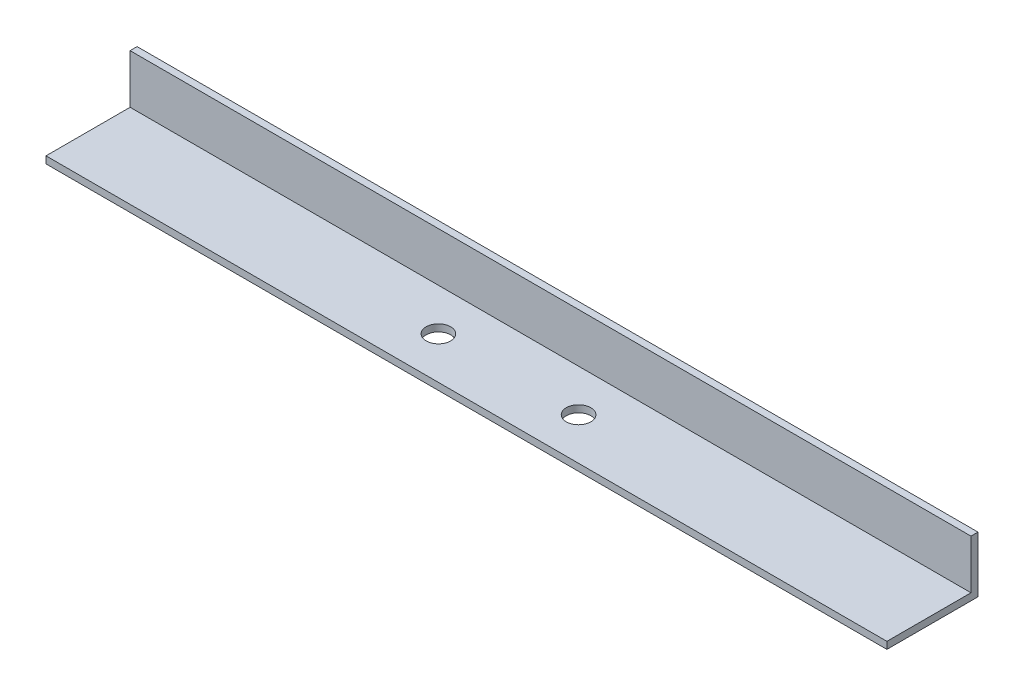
ISO-10303-21;
HEADER;
FILE_DESCRIPTION(('STEP AP214'),'2;1');
FILE_NAME('part.step','',(''),(''),'','','');
FILE_SCHEMA(('AUTOMOTIVE_DESIGN { 1 0 10303 214 1 1 1 1 }'));
ENDSEC;
DATA;
#1=APPLICATION_CONTEXT('core data for automotive mechanical design processes');
#2=APPLICATION_PROTOCOL_DEFINITION('international standard','automotive_design',2000,#1);
#3=PRODUCT_CONTEXT('',#1,'mechanical');
#4=PRODUCT('Part','Part','',(#3));
#5=PRODUCT_RELATED_PRODUCT_CATEGORY('part','',(#4));
#6=PRODUCT_DEFINITION_FORMATION('','',#4);
#7=PRODUCT_DEFINITION_CONTEXT('part definition',#1,'design');
#8=PRODUCT_DEFINITION('design','',#6,#7);
#9=PRODUCT_DEFINITION_SHAPE('','',#8);
#10=(LENGTH_UNIT() NAMED_UNIT(*) SI_UNIT(.MILLI.,.METRE.));
#11=(NAMED_UNIT(*) PLANE_ANGLE_UNIT() SI_UNIT($,.RADIAN.));
#12=(NAMED_UNIT(*) SI_UNIT($,.STERADIAN.) SOLID_ANGLE_UNIT());
#13=UNCERTAINTY_MEASURE_WITH_UNIT(LENGTH_MEASURE(1.E-05),#10,'distance_accuracy_value','');
#14=(GEOMETRIC_REPRESENTATION_CONTEXT(3) GLOBAL_UNCERTAINTY_ASSIGNED_CONTEXT((#13)) GLOBAL_UNIT_ASSIGNED_CONTEXT((#10,
#11,#12)) REPRESENTATION_CONTEXT('',''));
#15=CARTESIAN_POINT('',(0.,0.,0.));
#16=DIRECTION('',(0.,0.,1.));
#17=DIRECTION('',(1.,0.,0.));
#18=AXIS2_PLACEMENT_3D('',#15,#16,#17);
#19=CARTESIAN_POINT('',(0.,0.,13.));
#20=DIRECTION('',(1.,0.,0.));
#21=DIRECTION('',(0.,0.,-1.));
#22=AXIS2_PLACEMENT_3D('',#19,#20,#21);
#23=PLANE('',#22);
#24=DIRECTION('',(0.,-1.,0.));
#25=VECTOR('',#24,1.);
#26=CARTESIAN_POINT('',(0.,0.,13.));
#27=LINE('',#26,#25);
#28=CARTESIAN_POINT('',(0.,0.999999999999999,13.));
#29=VERTEX_POINT('',#28);
#30=CARTESIAN_POINT('',(0.,0.,13.));
#31=VERTEX_POINT('',#30);
#32=EDGE_CURVE('E96',#29,#31,#27,.T.);
#33=ORIENTED_EDGE('',*,*,#32,.F.);
#34=DIRECTION('',(0.,0.,1.));
#35=VECTOR('',#34,1.);
#36=CARTESIAN_POINT('',(0.,1.,13.));
#37=LINE('',#36,#35);
#38=CARTESIAN_POINT('',(0.,0.999999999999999,0.999999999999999));
#39=VERTEX_POINT('',#38);
#40=EDGE_CURVE('E46',#39,#29,#37,.T.);
#41=ORIENTED_EDGE('',*,*,#40,.F.);
#42=DIRECTION('',(0.,-1.,0.));
#43=VECTOR('',#42,1.);
#44=CARTESIAN_POINT('',(0.,8.,1.));
#45=LINE('',#44,#43);
#46=CARTESIAN_POINT('',(0.,8.,1.));
#47=VERTEX_POINT('',#46);
#48=EDGE_CURVE('E83',#47,#39,#45,.T.);
#49=ORIENTED_EDGE('',*,*,#48,.F.);
#50=DIRECTION('',(0.,0.,-1.));
#51=VECTOR('',#50,1.);
#52=CARTESIAN_POINT('',(0.,8.,13.));
#53=LINE('',#52,#51);
#54=CARTESIAN_POINT('',(0.,8.,0.));
#55=VERTEX_POINT('',#54);
#56=EDGE_CURVE('E75',#47,#55,#53,.T.);
#57=ORIENTED_EDGE('',*,*,#56,.T.);
#58=DIRECTION('',(0.,-1.,0.));
#59=VECTOR('',#58,1.);
#60=CARTESIAN_POINT('',(0.,0.,0.));
#61=LINE('',#60,#59);
#62=CARTESIAN_POINT('',(0.,0.,0.));
#63=VERTEX_POINT('',#62);
#64=EDGE_CURVE('E80',#55,#63,#61,.T.);
#65=ORIENTED_EDGE('',*,*,#64,.T.);
#66=DIRECTION('',(0.,0.,-1.));
#67=VECTOR('',#66,1.);
#68=CARTESIAN_POINT('',(0.,0.,13.));
#69=LINE('',#68,#67);
#70=EDGE_CURVE('E11',#31,#63,#69,.T.);
#71=ORIENTED_EDGE('',*,*,#70,.F.);
#72=EDGE_LOOP('',(#33,#41,#49,#57,#65,#71));
#73=FACE_BOUND('',#72,.T.);
#74=ADVANCED_FACE('F30',(#73),#23,.F.);
#75=CARTESIAN_POINT('',(0.,0.,13.));
#76=DIRECTION('',(0.,1.,0.));
#77=DIRECTION('',(0.,0.,1.));
#78=AXIS2_PLACEMENT_3D('',#75,#76,#77);
#79=PLANE('',#78);
#80=CARTESIAN_POINT('',(70.,0.,7.));
#81=DIRECTION('',(0.,-1.,0.));
#82=DIRECTION('',(0.,0.,-1.));
#83=AXIS2_PLACEMENT_3D('',#80,#81,#82);
#84=CIRCLE('',#83,1.75);
#85=CARTESIAN_POINT('',(70.,0.,5.25));
#86=VERTEX_POINT('',#85);
#87=EDGE_CURVE('E123',#86,#86,#84,.T.);
#88=ORIENTED_EDGE('',*,*,#87,.F.);
#89=EDGE_LOOP('',(#88));
#90=FACE_BOUND('',#89,.T.);
#91=CARTESIAN_POINT('',(50.,0.,7.));
#92=DIRECTION('',(0.,-1.,0.));
#93=DIRECTION('',(0.,0.,-1.));
#94=AXIS2_PLACEMENT_3D('',#91,#92,#93);
#95=CIRCLE('',#94,1.75);
#96=CARTESIAN_POINT('',(50.,0.,5.25));
#97=VERTEX_POINT('',#96);
#98=EDGE_CURVE('E114',#97,#97,#95,.T.);
#99=ORIENTED_EDGE('',*,*,#98,.F.);
#100=EDGE_LOOP('',(#99));
#101=FACE_BOUND('',#100,.T.);
#102=DIRECTION('',(1.,0.,0.));
#103=VECTOR('',#102,1.);
#104=CARTESIAN_POINT('',(0.,0.,0.));
#105=LINE('',#104,#103);
#106=CARTESIAN_POINT('',(120.,0.,0.));
#107=VERTEX_POINT('',#106);
#108=EDGE_CURVE('E100',#63,#107,#105,.T.);
#109=ORIENTED_EDGE('',*,*,#108,.T.);
#110=DIRECTION('',(0.,0.,-1.));
#111=VECTOR('',#110,1.);
#112=CARTESIAN_POINT('',(120.,0.,13.));
#113=LINE('',#112,#111);
#114=CARTESIAN_POINT('',(120.,0.,13.));
#115=VERTEX_POINT('',#114);
#116=EDGE_CURVE('E38',#115,#107,#113,.T.);
#117=ORIENTED_EDGE('',*,*,#116,.F.);
#118=DIRECTION('',(1.,0.,0.));
#119=VECTOR('',#118,1.);
#120=CARTESIAN_POINT('',(0.,0.,13.));
#121=LINE('',#120,#119);
#122=EDGE_CURVE('E55',#31,#115,#121,.T.);
#123=ORIENTED_EDGE('',*,*,#122,.F.);
#124=ORIENTED_EDGE('',*,*,#70,.T.);
#125=EDGE_LOOP('',(#109,#117,#123,#124));
#126=FACE_BOUND('',#125,.T.);
#127=ADVANCED_FACE('F155',(#90,#101,#126),#79,.F.);
#128=CARTESIAN_POINT('',(120.,0.,13.));
#129=DIRECTION('',(-1.,0.,0.));
#130=DIRECTION('',(0.,0.,1.));
#131=AXIS2_PLACEMENT_3D('',#128,#129,#130);
#132=PLANE('',#131);
#133=DIRECTION('',(0.,-1.,0.));
#134=VECTOR('',#133,1.);
#135=CARTESIAN_POINT('',(120.,8.,1.));
#136=LINE('',#135,#134);
#137=CARTESIAN_POINT('',(120.,8.,1.));
#138=VERTEX_POINT('',#137);
#139=CARTESIAN_POINT('',(120.,0.999999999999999,0.999999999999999));
#140=VERTEX_POINT('',#139);
#141=EDGE_CURVE('E126',#138,#140,#136,.T.);
#142=ORIENTED_EDGE('',*,*,#141,.T.);
#143=DIRECTION('',(0.,0.,1.));
#144=VECTOR('',#143,1.);
#145=CARTESIAN_POINT('',(120.,1.,13.));
#146=LINE('',#145,#144);
#147=CARTESIAN_POINT('',(120.,1.,13.));
#148=VERTEX_POINT('',#147);
#149=EDGE_CURVE('E129',#140,#148,#146,.T.);
#150=ORIENTED_EDGE('',*,*,#149,.T.);
#151=DIRECTION('',(0.,1.,0.));
#152=VECTOR('',#151,1.);
#153=CARTESIAN_POINT('',(120.,0.,13.));
#154=LINE('',#153,#152);
#155=EDGE_CURVE('E87',#115,#148,#154,.T.);
#156=ORIENTED_EDGE('',*,*,#155,.F.);
#157=ORIENTED_EDGE('',*,*,#116,.T.);
#158=DIRECTION('',(0.,1.,0.));
#159=VECTOR('',#158,1.);
#160=CARTESIAN_POINT('',(120.,0.,0.));
#161=LINE('',#160,#159);
#162=CARTESIAN_POINT('',(120.,8.,0.));
#163=VERTEX_POINT('',#162);
#164=EDGE_CURVE('E97',#107,#163,#161,.T.);
#165=ORIENTED_EDGE('',*,*,#164,.T.);
#166=DIRECTION('',(0.,0.,-1.));
#167=VECTOR('',#166,1.);
#168=CARTESIAN_POINT('',(120.,8.,13.));
#169=LINE('',#168,#167);
#170=EDGE_CURVE('E86',#138,#163,#169,.T.);
#171=ORIENTED_EDGE('',*,*,#170,.F.);
#172=EDGE_LOOP('',(#142,#150,#156,#157,#165,#171));
#173=FACE_BOUND('',#172,.T.);
#174=ADVANCED_FACE('F142',(#173),#132,.F.);
#175=CARTESIAN_POINT('',(0.,8.,13.));
#176=DIRECTION('',(0.,-1.,0.));
#177=DIRECTION('',(0.,0.,-1.));
#178=AXIS2_PLACEMENT_3D('',#175,#176,#177);
#179=PLANE('',#178);
#180=ORIENTED_EDGE('',*,*,#56,.F.);
#181=DIRECTION('',(-1.,0.,0.));
#182=VECTOR('',#181,1.);
#183=CARTESIAN_POINT('',(120.,8.,1.));
#184=LINE('',#183,#182);
#185=EDGE_CURVE('E131',#138,#47,#184,.T.);
#186=ORIENTED_EDGE('',*,*,#185,.F.);
#187=ORIENTED_EDGE('',*,*,#170,.T.);
#188=DIRECTION('',(-1.,0.,0.));
#189=VECTOR('',#188,1.);
#190=CARTESIAN_POINT('',(0.,8.,0.));
#191=LINE('',#190,#189);
#192=EDGE_CURVE('E90',#163,#55,#191,.T.);
#193=ORIENTED_EDGE('',*,*,#192,.T.);
#194=EDGE_LOOP('',(#180,#186,#187,#193));
#195=FACE_BOUND('',#194,.T.);
#196=ADVANCED_FACE('F91',(#195),#179,.F.);
#197=CARTESIAN_POINT('',(0.,8.,13.));
#198=DIRECTION('',(0.,0.,-1.));
#199=DIRECTION('',(-1.,0.,0.));
#200=AXIS2_PLACEMENT_3D('',#197,#198,#199);
#201=PLANE('',#200);
#202=ORIENTED_EDGE('',*,*,#155,.T.);
#203=DIRECTION('',(-1.,0.,0.));
#204=VECTOR('',#203,1.);
#205=CARTESIAN_POINT('',(120.,1.,13.));
#206=LINE('',#205,#204);
#207=EDGE_CURVE('E101',#148,#29,#206,.T.);
#208=ORIENTED_EDGE('',*,*,#207,.T.);
#209=ORIENTED_EDGE('',*,*,#32,.T.);
#210=ORIENTED_EDGE('',*,*,#122,.T.);
#211=EDGE_LOOP('',(#202,#208,#209,#210));
#212=FACE_BOUND('',#211,.T.);
#213=ADVANCED_FACE('F138',(#212),#201,.F.);
#214=CARTESIAN_POINT('',(0.,8.,0.));
#215=DIRECTION('',(0.,0.,-1.));
#216=DIRECTION('',(-1.,0.,0.));
#217=AXIS2_PLACEMENT_3D('',#214,#215,#216);
#218=PLANE('',#217);
#219=ORIENTED_EDGE('',*,*,#64,.F.);
#220=ORIENTED_EDGE('',*,*,#192,.F.);
#221=ORIENTED_EDGE('',*,*,#164,.F.);
#222=ORIENTED_EDGE('',*,*,#108,.F.);
#223=EDGE_LOOP('',(#219,#220,#221,#222));
#224=FACE_BOUND('',#223,.T.);
#225=ADVANCED_FACE('F99',(#224),#218,.T.);
#226=CARTESIAN_POINT('',(120.,1.,13.));
#227=DIRECTION('',(0.,-1.,0.));
#228=DIRECTION('',(0.,0.,-1.));
#229=AXIS2_PLACEMENT_3D('',#226,#227,#228);
#230=PLANE('',#229);
#231=CARTESIAN_POINT('',(70.,0.999999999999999,7.));
#232=DIRECTION('',(0.,-1.,0.));
#233=DIRECTION('',(0.,0.,-1.));
#234=AXIS2_PLACEMENT_3D('',#231,#232,#233);
#235=CIRCLE('',#234,1.75);
#236=CARTESIAN_POINT('',(70.,0.999999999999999,5.25));
#237=VERTEX_POINT('',#236);
#238=EDGE_CURVE('E33',#237,#237,#235,.T.);
#239=ORIENTED_EDGE('',*,*,#238,.T.);
#240=EDGE_LOOP('',(#239));
#241=FACE_BOUND('',#240,.T.);
#242=CARTESIAN_POINT('',(50.,0.999999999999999,7.));
#243=DIRECTION('',(0.,-1.,0.));
#244=DIRECTION('',(0.,0.,-1.));
#245=AXIS2_PLACEMENT_3D('',#242,#243,#244);
#246=CIRCLE('',#245,1.75);
#247=CARTESIAN_POINT('',(50.,0.999999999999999,5.25));
#248=VERTEX_POINT('',#247);
#249=EDGE_CURVE('E112',#248,#248,#246,.T.);
#250=ORIENTED_EDGE('',*,*,#249,.T.);
#251=EDGE_LOOP('',(#250));
#252=FACE_BOUND('',#251,.T.);
#253=ORIENTED_EDGE('',*,*,#40,.T.);
#254=ORIENTED_EDGE('',*,*,#207,.F.);
#255=ORIENTED_EDGE('',*,*,#149,.F.);
#256=DIRECTION('',(-1.,0.,0.));
#257=VECTOR('',#256,1.);
#258=CARTESIAN_POINT('',(120.,0.999999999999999,0.999999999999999));
#259=LINE('',#258,#257);
#260=EDGE_CURVE('E104',#140,#39,#259,.T.);
#261=ORIENTED_EDGE('',*,*,#260,.T.);
#262=EDGE_LOOP('',(#253,#254,#255,#261));
#263=FACE_BOUND('',#262,.T.);
#264=ADVANCED_FACE('F145',(#241,#252,#263),#230,.F.);
#265=CARTESIAN_POINT('',(120.,8.,1.));
#266=DIRECTION('',(0.,0.,-1.));
#267=DIRECTION('',(0.,1.,0.));
#268=AXIS2_PLACEMENT_3D('',#265,#266,#267);
#269=PLANE('',#268);
#270=ORIENTED_EDGE('',*,*,#48,.T.);
#271=ORIENTED_EDGE('',*,*,#260,.F.);
#272=ORIENTED_EDGE('',*,*,#141,.F.);
#273=ORIENTED_EDGE('',*,*,#185,.T.);
#274=EDGE_LOOP('',(#270,#271,#272,#273));
#275=FACE_BOUND('',#274,.T.);
#276=ADVANCED_FACE('F153',(#275),#269,.F.);
#277=CARTESIAN_POINT('',(50.,10.,7.));
#278=DIRECTION('',(0.,-1.,0.));
#279=DIRECTION('',(0.,0.,-1.));
#280=AXIS2_PLACEMENT_3D('',#277,#278,#279);
#281=CYLINDRICAL_SURFACE('',#280,1.75);
#282=ORIENTED_EDGE('',*,*,#98,.T.);
#283=EDGE_LOOP('',(#282));
#284=FACE_BOUND('',#283,.T.);
#285=ORIENTED_EDGE('',*,*,#249,.F.);
#286=EDGE_LOOP('',(#285));
#287=FACE_BOUND('',#286,.T.);
#288=ADVANCED_FACE('F174',(#284,#287),#281,.F.);
#289=CARTESIAN_POINT('',(70.,10.,7.));
#290=DIRECTION('',(0.,-1.,0.));
#291=DIRECTION('',(0.,0.,-1.));
#292=AXIS2_PLACEMENT_3D('',#289,#290,#291);
#293=CYLINDRICAL_SURFACE('',#292,1.75);
#294=ORIENTED_EDGE('',*,*,#87,.T.);
#295=EDGE_LOOP('',(#294));
#296=FACE_BOUND('',#295,.T.);
#297=ORIENTED_EDGE('',*,*,#238,.F.);
#298=EDGE_LOOP('',(#297));
#299=FACE_BOUND('',#298,.T.);
#300=ADVANCED_FACE('F180',(#296,#299),#293,.F.);
#301=CLOSED_SHELL('',(#74,#127,#174,#196,#213,#225,#264,#276,#288,#300));
#302=MANIFOLD_SOLID_BREP('B2',#301);
#303=ADVANCED_BREP_SHAPE_REPRESENTATION('',(#18,#302),#14);
#304=SHAPE_DEFINITION_REPRESENTATION(#9,#303);
ENDSEC;
END-ISO-10303-21;
